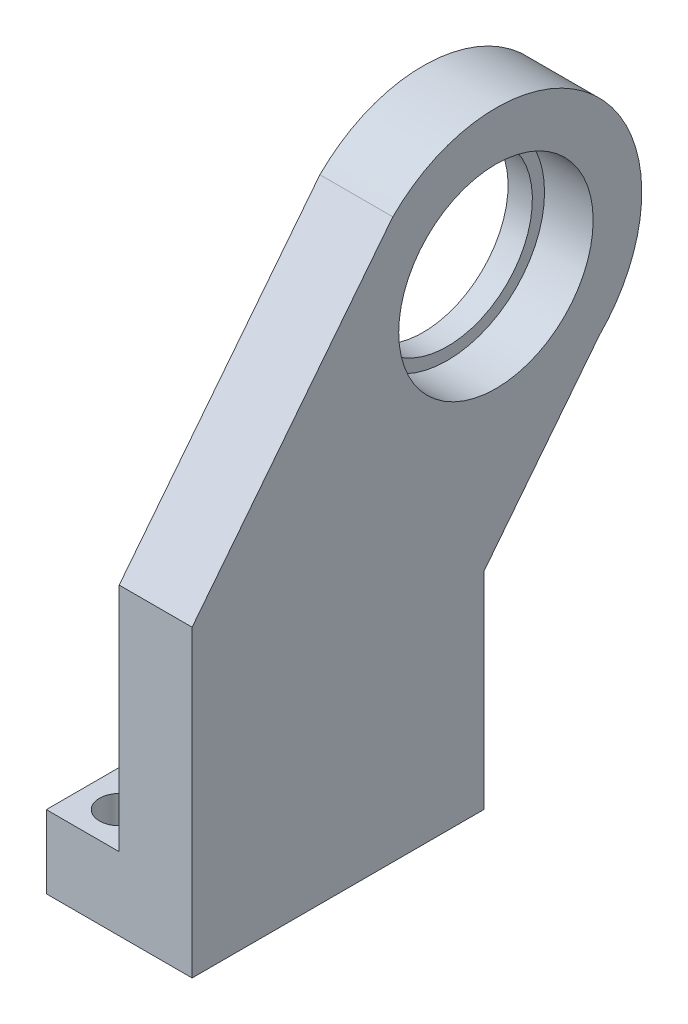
ISO-10303-21;
HEADER;
FILE_DESCRIPTION(('STEP AP214'),'2;1');
FILE_NAME('part.step','',(''),(''),'','','');
FILE_SCHEMA(('AUTOMOTIVE_DESIGN { 1 0 10303 214 1 1 1 1 }'));
ENDSEC;
DATA;
#1=APPLICATION_CONTEXT('core data for automotive mechanical design processes');
#2=APPLICATION_PROTOCOL_DEFINITION('international standard','automotive_design',2000,#1);
#3=PRODUCT_CONTEXT('',#1,'mechanical');
#4=PRODUCT('Part','Part','',(#3));
#5=PRODUCT_RELATED_PRODUCT_CATEGORY('part','',(#4));
#6=PRODUCT_DEFINITION_FORMATION('','',#4);
#7=PRODUCT_DEFINITION_CONTEXT('part definition',#1,'design');
#8=PRODUCT_DEFINITION('design','',#6,#7);
#9=PRODUCT_DEFINITION_SHAPE('','',#8);
#10=(LENGTH_UNIT() NAMED_UNIT(*) SI_UNIT(.MILLI.,.METRE.));
#11=(NAMED_UNIT(*) PLANE_ANGLE_UNIT() SI_UNIT($,.RADIAN.));
#12=(NAMED_UNIT(*) SI_UNIT($,.STERADIAN.) SOLID_ANGLE_UNIT());
#13=UNCERTAINTY_MEASURE_WITH_UNIT(LENGTH_MEASURE(1.E-05),#10,'distance_accuracy_value','');
#14=(GEOMETRIC_REPRESENTATION_CONTEXT(3) GLOBAL_UNCERTAINTY_ASSIGNED_CONTEXT((#13)) GLOBAL_UNIT_ASSIGNED_CONTEXT((#10,
#11,#12)) REPRESENTATION_CONTEXT('',''));
#15=CARTESIAN_POINT('',(0.,0.,0.));
#16=DIRECTION('',(0.,0.,1.));
#17=DIRECTION('',(1.,0.,0.));
#18=AXIS2_PLACEMENT_3D('',#15,#16,#17);
#19=CARTESIAN_POINT('',(-12.,25.,50.));
#20=DIRECTION('',(1.,0.,0.));
#21=DIRECTION('',(0.,1.,0.));
#22=AXIS2_PLACEMENT_3D('',#19,#20,#21);
#23=CYLINDRICAL_SURFACE('',#22,14.);
#24=CARTESIAN_POINT('',(0.,25.,50.));
#25=DIRECTION('',(1.,0.,0.));
#26=DIRECTION('',(0.,1.,0.));
#27=AXIS2_PLACEMENT_3D('',#24,#25,#26);
#28=CIRCLE('',#27,14.);
#29=CARTESIAN_POINT('',(0.,39.,50.));
#30=VERTEX_POINT('',#29);
#31=EDGE_CURVE('E195',#30,#30,#28,.F.);
#32=ORIENTED_EDGE('',*,*,#31,.T.);
#33=EDGE_LOOP('',(#32));
#34=FACE_BOUND('',#33,.T.);
#35=CARTESIAN_POINT('',(3.99999999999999,25.,50.));
#36=DIRECTION('',(1.,0.,0.));
#37=DIRECTION('',(0.,1.,0.));
#38=AXIS2_PLACEMENT_3D('',#35,#36,#37);
#39=CIRCLE('',#38,14.);
#40=CARTESIAN_POINT('',(3.99999999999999,39.,50.));
#41=VERTEX_POINT('',#40);
#42=EDGE_CURVE('E20',#41,#41,#39,.F.);
#43=ORIENTED_EDGE('',*,*,#42,.F.);
#44=EDGE_LOOP('',(#43));
#45=FACE_BOUND('',#44,.T.);
#46=ADVANCED_FACE('F17',(#34,#45),#23,.F.);
#47=CARTESIAN_POINT('',(4.,25.,50.));
#48=DIRECTION('',(1.,0.,0.));
#49=DIRECTION('',(0.,1.,0.));
#50=AXIS2_PLACEMENT_3D('',#47,#48,#49);
#51=PLANE('',#50);
#52=CARTESIAN_POINT('',(4.,25.,50.));
#53=DIRECTION('',(1.,0.,0.));
#54=DIRECTION('',(0.,1.,0.));
#55=AXIS2_PLACEMENT_3D('',#52,#53,#54);
#56=CIRCLE('',#55,16.);
#57=CARTESIAN_POINT('',(3.99999999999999,41.,50.));
#58=VERTEX_POINT('',#57);
#59=EDGE_CURVE('E177',#58,#58,#56,.T.);
#60=ORIENTED_EDGE('',*,*,#59,.T.);
#61=EDGE_LOOP('',(#60));
#62=FACE_BOUND('',#61,.T.);
#63=ORIENTED_EDGE('',*,*,#42,.T.);
#64=EDGE_LOOP('',(#63));
#65=FACE_BOUND('',#64,.T.);
#66=ADVANCED_FACE('F202',(#62,#65),#51,.T.);
#67=CARTESIAN_POINT('',(-6.,-50.,94.));
#68=DIRECTION('',(0.,1.,0.));
#69=DIRECTION('',(-1.,0.,0.));
#70=AXIS2_PLACEMENT_3D('',#67,#68,#69);
#71=CYLINDRICAL_SURFACE('',#70,3.25);
#72=CARTESIAN_POINT('',(-6.,-50.,94.));
#73=DIRECTION('',(0.,1.,0.));
#74=DIRECTION('',(-1.,0.,0.));
#75=AXIS2_PLACEMENT_3D('',#72,#73,#74);
#76=CIRCLE('',#75,3.25);
#77=CARTESIAN_POINT('',(-9.25,-50.,94.));
#78=VERTEX_POINT('',#77);
#79=EDGE_CURVE('E186',#78,#78,#76,.F.);
#80=ORIENTED_EDGE('',*,*,#79,.T.);
#81=EDGE_LOOP('',(#80));
#82=FACE_BOUND('',#81,.T.);
#83=CARTESIAN_POINT('',(-5.99999999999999,-38.,94.));
#84=DIRECTION('',(0.,1.,0.));
#85=DIRECTION('',(-1.,0.,0.));
#86=AXIS2_PLACEMENT_3D('',#83,#84,#85);
#87=CIRCLE('',#86,3.25);
#88=CARTESIAN_POINT('',(-9.24999999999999,-38.,94.));
#89=VERTEX_POINT('',#88);
#90=EDGE_CURVE('E193',#89,#89,#87,.T.);
#91=ORIENTED_EDGE('',*,*,#90,.T.);
#92=EDGE_LOOP('',(#91));
#93=FACE_BOUND('',#92,.T.);
#94=ADVANCED_FACE('F209',(#82,#93),#71,.F.);
#95=CARTESIAN_POINT('',(-6.00000000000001,-50.,58.));
#96=DIRECTION('',(0.,1.,0.));
#97=DIRECTION('',(-1.,0.,0.));
#98=AXIS2_PLACEMENT_3D('',#95,#96,#97);
#99=CYLINDRICAL_SURFACE('',#98,3.25);
#100=CARTESIAN_POINT('',(-6.00000000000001,-50.,58.));
#101=DIRECTION('',(0.,1.,0.));
#102=DIRECTION('',(-1.,0.,0.));
#103=AXIS2_PLACEMENT_3D('',#100,#101,#102);
#104=CIRCLE('',#103,3.25);
#105=CARTESIAN_POINT('',(-9.25000000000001,-50.,58.));
#106=VERTEX_POINT('',#105);
#107=EDGE_CURVE('E138',#106,#106,#104,.F.);
#108=ORIENTED_EDGE('',*,*,#107,.T.);
#109=EDGE_LOOP('',(#108));
#110=FACE_BOUND('',#109,.T.);
#111=CARTESIAN_POINT('',(-5.99999999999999,-38.,58.));
#112=DIRECTION('',(0.,1.,0.));
#113=DIRECTION('',(-1.,0.,0.));
#114=AXIS2_PLACEMENT_3D('',#111,#112,#113);
#115=CIRCLE('',#114,3.25);
#116=CARTESIAN_POINT('',(-9.24999999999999,-38.,58.));
#117=VERTEX_POINT('',#116);
#118=EDGE_CURVE('E159',#117,#117,#115,.T.);
#119=ORIENTED_EDGE('',*,*,#118,.T.);
#120=EDGE_LOOP('',(#119));
#121=FACE_BOUND('',#120,.T.);
#122=ADVANCED_FACE('F252',(#110,#121),#99,.F.);
#123=CARTESIAN_POINT('',(0.,50.,0.));
#124=DIRECTION('',(1.,0.,0.));
#125=DIRECTION('',(0.,1.,0.));
#126=AXIS2_PLACEMENT_3D('',#123,#124,#125);
#127=PLANE('',#126);
#128=DIRECTION('',(0.,0.,1.));
#129=VECTOR('',#128,1.);
#130=CARTESIAN_POINT('',(0.,-38.,0.));
#131=LINE('',#130,#129);
#132=CARTESIAN_POINT('',(0.,-38.,52.));
#133=VERTEX_POINT('',#132);
#134=CARTESIAN_POINT('',(0.,-38.,100.));
#135=VERTEX_POINT('',#134);
#136=EDGE_CURVE('E156',#133,#135,#131,.T.);
#137=ORIENTED_EDGE('',*,*,#136,.T.);
#138=DIRECTION('',(0.,1.,0.));
#139=VECTOR('',#138,1.);
#140=CARTESIAN_POINT('',(0.,0.,100.));
#141=LINE('',#140,#139);
#142=CARTESIAN_POINT('',(0.,0.,100.));
#143=VERTEX_POINT('',#142);
#144=EDGE_CURVE('E96',#143,#135,#141,.F.);
#145=ORIENTED_EDGE('',*,*,#144,.F.);
#146=DIRECTION('',(0.,-0.785839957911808,0.618429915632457));
#147=VECTOR('',#146,1.);
#148=CARTESIAN_POINT('',(0.,0.,100.));
#149=LINE('',#148,#147);
#150=CARTESIAN_POINT('',(0.,41.9705627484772,66.9705627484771));
#151=VERTEX_POINT('',#150);
#152=EDGE_CURVE('E92',#151,#143,#149,.T.);
#153=ORIENTED_EDGE('',*,*,#152,.F.);
#154=CARTESIAN_POINT('',(0.,25.,50.));
#155=DIRECTION('',(1.,0.,0.));
#156=DIRECTION('',(0.,1.,0.));
#157=AXIS2_PLACEMENT_3D('',#154,#155,#156);
#158=CIRCLE('',#157,24.);
#159=CARTESIAN_POINT('',(0.,8.02943725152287,33.0294372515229));
#160=VERTEX_POINT('',#159);
#161=EDGE_CURVE('E82',#160,#151,#158,.T.);
#162=ORIENTED_EDGE('',*,*,#161,.F.);
#163=DIRECTION('',(0.,0.785839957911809,-0.618429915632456));
#164=VECTOR('',#163,1.);
#165=CARTESIAN_POINT('',(0.,8.02943725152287,33.0294372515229));
#166=LINE('',#165,#164);
#167=CARTESIAN_POINT('',(0.,-16.0764894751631,52.));
#168=VERTEX_POINT('',#167);
#169=EDGE_CURVE('E77',#168,#160,#166,.T.);
#170=ORIENTED_EDGE('',*,*,#169,.F.);
#171=DIRECTION('',(0.,1.,0.));
#172=VECTOR('',#171,1.);
#173=CARTESIAN_POINT('',(0.,-16.0764894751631,52.));
#174=LINE('',#173,#172);
#175=EDGE_CURVE('E148',#133,#168,#174,.T.);
#176=ORIENTED_EDGE('',*,*,#175,.F.);
#177=EDGE_LOOP('',(#137,#145,#153,#162,#170,#176));
#178=FACE_BOUND('',#177,.T.);
#179=ORIENTED_EDGE('',*,*,#31,.F.);
#180=EDGE_LOOP('',(#179));
#181=FACE_BOUND('',#180,.T.);
#182=ADVANCED_FACE('F94',(#178,#181),#127,.F.);
#183=CARTESIAN_POINT('',(-12.,50.,100.));
#184=DIRECTION('',(1.,0.,0.));
#185=DIRECTION('',(0.,1.,0.));
#186=AXIS2_PLACEMENT_3D('',#183,#184,#185);
#187=PLANE('',#186);
#188=DIRECTION('',(0.,0.,1.));
#189=VECTOR('',#188,1.);
#190=CARTESIAN_POINT('',(-12.,-50.,100.));
#191=LINE('',#190,#189);
#192=CARTESIAN_POINT('',(-12.,-50.,52.));
#193=VERTEX_POINT('',#192);
#194=CARTESIAN_POINT('',(-12.,-50.,100.));
#195=VERTEX_POINT('',#194);
#196=EDGE_CURVE('E135',#193,#195,#191,.T.);
#197=ORIENTED_EDGE('',*,*,#196,.T.);
#198=DIRECTION('',(0.,1.,0.));
#199=VECTOR('',#198,1.);
#200=CARTESIAN_POINT('',(-12.,0.,100.));
#201=LINE('',#200,#199);
#202=CARTESIAN_POINT('',(-12.,-38.,100.));
#203=VERTEX_POINT('',#202);
#204=EDGE_CURVE('E121',#203,#195,#201,.F.);
#205=ORIENTED_EDGE('',*,*,#204,.F.);
#206=DIRECTION('',(0.,0.,1.));
#207=VECTOR('',#206,1.);
#208=CARTESIAN_POINT('',(-12.,-38.,0.));
#209=LINE('',#208,#207);
#210=CARTESIAN_POINT('',(-12.,-38.,52.));
#211=VERTEX_POINT('',#210);
#212=EDGE_CURVE('E158',#203,#211,#209,.F.);
#213=ORIENTED_EDGE('',*,*,#212,.T.);
#214=DIRECTION('',(0.,1.,0.));
#215=VECTOR('',#214,1.);
#216=CARTESIAN_POINT('',(-12.,-16.0764894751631,52.));
#217=LINE('',#216,#215);
#218=EDGE_CURVE('E132',#193,#211,#217,.T.);
#219=ORIENTED_EDGE('',*,*,#218,.F.);
#220=EDGE_LOOP('',(#197,#205,#213,#219));
#221=FACE_BOUND('',#220,.T.);
#222=ADVANCED_FACE('F245',(#221),#187,.F.);
#223=CARTESIAN_POINT('',(-12.,-38.,0.));
#224=DIRECTION('',(0.,-1.,0.));
#225=DIRECTION('',(1.,0.,0.));
#226=AXIS2_PLACEMENT_3D('',#223,#224,#225);
#227=PLANE('',#226);
#228=ORIENTED_EDGE('',*,*,#212,.F.);
#229=DIRECTION('',(1.,0.,0.));
#230=VECTOR('',#229,1.);
#231=CARTESIAN_POINT('',(0.,-38.,100.));
#232=LINE('',#231,#230);
#233=EDGE_CURVE('E165',#135,#203,#232,.F.);
#234=ORIENTED_EDGE('',*,*,#233,.F.);
#235=ORIENTED_EDGE('',*,*,#136,.F.);
#236=DIRECTION('',(1.,0.,0.));
#237=VECTOR('',#236,1.);
#238=CARTESIAN_POINT('',(-12.,-38.,52.));
#239=LINE('',#238,#237);
#240=EDGE_CURVE('E142',#211,#133,#239,.T.);
#241=ORIENTED_EDGE('',*,*,#240,.F.);
#242=EDGE_LOOP('',(#228,#234,#235,#241));
#243=FACE_BOUND('',#242,.T.);
#244=ORIENTED_EDGE('',*,*,#118,.F.);
#245=EDGE_LOOP('',(#244));
#246=FACE_BOUND('',#245,.T.);
#247=ORIENTED_EDGE('',*,*,#90,.F.);
#248=EDGE_LOOP('',(#247));
#249=FACE_BOUND('',#248,.T.);
#250=ADVANCED_FACE('F241',(#243,#246,#249),#227,.F.);
#251=CARTESIAN_POINT('',(4.,25.,50.));
#252=DIRECTION('',(1.,0.,0.));
#253=DIRECTION('',(0.,1.,0.));
#254=AXIS2_PLACEMENT_3D('',#251,#252,#253);
#255=CYLINDRICAL_SURFACE('',#254,16.);
#256=ORIENTED_EDGE('',*,*,#59,.F.);
#257=EDGE_LOOP('',(#256));
#258=FACE_BOUND('',#257,.T.);
#259=CARTESIAN_POINT('',(12.,25.,50.));
#260=DIRECTION('',(1.,0.,0.));
#261=DIRECTION('',(0.,1.,0.));
#262=AXIS2_PLACEMENT_3D('',#259,#260,#261);
#263=CIRCLE('',#262,16.);
#264=CARTESIAN_POINT('',(12.,41.,50.));
#265=VERTEX_POINT('',#264);
#266=EDGE_CURVE('E126',#265,#265,#263,.T.);
#267=ORIENTED_EDGE('',*,*,#266,.T.);
#268=EDGE_LOOP('',(#267));
#269=FACE_BOUND('',#268,.T.);
#270=ADVANCED_FACE('F237',(#258,#269),#255,.F.);
#271=CARTESIAN_POINT('',(-12.,-50.,100.));
#272=DIRECTION('',(0.,1.,0.));
#273=DIRECTION('',(0.,0.,1.));
#274=AXIS2_PLACEMENT_3D('',#271,#272,#273);
#275=PLANE('',#274);
#276=DIRECTION('',(0.,0.,1.));
#277=VECTOR('',#276,1.);
#278=CARTESIAN_POINT('',(12.,-50.,100.));
#279=LINE('',#278,#277);
#280=CARTESIAN_POINT('',(12.,-50.,52.));
#281=VERTEX_POINT('',#280);
#282=CARTESIAN_POINT('',(12.,-50.,100.));
#283=VERTEX_POINT('',#282);
#284=EDGE_CURVE('E117',#281,#283,#279,.T.);
#285=ORIENTED_EDGE('',*,*,#284,.T.);
#286=DIRECTION('',(1.,0.,0.));
#287=VECTOR('',#286,1.);
#288=CARTESIAN_POINT('',(0.,-50.,100.));
#289=LINE('',#288,#287);
#290=EDGE_CURVE('E100',#195,#283,#289,.T.);
#291=ORIENTED_EDGE('',*,*,#290,.F.);
#292=ORIENTED_EDGE('',*,*,#196,.F.);
#293=DIRECTION('',(1.,0.,0.));
#294=VECTOR('',#293,1.);
#295=CARTESIAN_POINT('',(-12.,-50.,52.));
#296=LINE('',#295,#294);
#297=EDGE_CURVE('E129',#281,#193,#296,.F.);
#298=ORIENTED_EDGE('',*,*,#297,.F.);
#299=EDGE_LOOP('',(#285,#291,#292,#298));
#300=FACE_BOUND('',#299,.T.);
#301=ORIENTED_EDGE('',*,*,#107,.F.);
#302=EDGE_LOOP('',(#301));
#303=FACE_BOUND('',#302,.T.);
#304=ORIENTED_EDGE('',*,*,#79,.F.);
#305=EDGE_LOOP('',(#304));
#306=FACE_BOUND('',#305,.T.);
#307=ADVANCED_FACE('F233',(#300,#303,#306),#275,.F.);
#308=CARTESIAN_POINT('',(0.,0.,100.));
#309=DIRECTION('',(0.,0.,1.));
#310=DIRECTION('',(1.,0.,0.));
#311=AXIS2_PLACEMENT_3D('',#308,#309,#310);
#312=PLANE('',#311);
#313=ORIENTED_EDGE('',*,*,#204,.T.);
#314=ORIENTED_EDGE('',*,*,#290,.T.);
#315=DIRECTION('',(0.,-1.,0.));
#316=VECTOR('',#315,1.);
#317=CARTESIAN_POINT('',(12.,50.,100.));
#318=LINE('',#317,#316);
#319=CARTESIAN_POINT('',(12.,0.,100.));
#320=VERTEX_POINT('',#319);
#321=EDGE_CURVE('E114',#283,#320,#318,.F.);
#322=ORIENTED_EDGE('',*,*,#321,.T.);
#323=DIRECTION('',(1.,0.,0.));
#324=VECTOR('',#323,1.);
#325=CARTESIAN_POINT('',(-12.,0.,100.));
#326=LINE('',#325,#324);
#327=EDGE_CURVE('E99',#143,#320,#326,.T.);
#328=ORIENTED_EDGE('',*,*,#327,.F.);
#329=ORIENTED_EDGE('',*,*,#144,.T.);
#330=ORIENTED_EDGE('',*,*,#233,.T.);
#331=EDGE_LOOP('',(#313,#314,#322,#328,#329,#330));
#332=FACE_BOUND('',#331,.T.);
#333=ADVANCED_FACE('F230',(#332),#312,.T.);
#334=CARTESIAN_POINT('',(-12.,0.,100.));
#335=DIRECTION('',(0.,0.618429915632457,0.785839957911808));
#336=DIRECTION('',(0.,-0.785839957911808,0.618429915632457));
#337=AXIS2_PLACEMENT_3D('',#334,#335,#336);
#338=PLANE('',#337);
#339=DIRECTION('',(0.,0.785839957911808,-0.618429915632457));
#340=VECTOR('',#339,1.);
#341=CARTESIAN_POINT('',(12.,0.,100.));
#342=LINE('',#341,#340);
#343=CARTESIAN_POINT('',(12.,41.9705627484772,66.9705627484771));
#344=VERTEX_POINT('',#343);
#345=EDGE_CURVE('E105',#320,#344,#342,.T.);
#346=ORIENTED_EDGE('',*,*,#345,.T.);
#347=DIRECTION('',(1.,0.,0.));
#348=VECTOR('',#347,1.);
#349=CARTESIAN_POINT('',(-12.,41.9705627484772,66.9705627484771));
#350=LINE('',#349,#348);
#351=EDGE_CURVE('E86',#151,#344,#350,.T.);
#352=ORIENTED_EDGE('',*,*,#351,.F.);
#353=ORIENTED_EDGE('',*,*,#152,.T.);
#354=ORIENTED_EDGE('',*,*,#327,.T.);
#355=EDGE_LOOP('',(#346,#352,#353,#354));
#356=FACE_BOUND('',#355,.T.);
#357=ADVANCED_FACE('F103',(#356),#338,.T.);
#358=CARTESIAN_POINT('',(-12.,25.,50.));
#359=DIRECTION('',(1.,0.,0.));
#360=DIRECTION('',(0.,1.,0.));
#361=AXIS2_PLACEMENT_3D('',#358,#359,#360);
#362=CYLINDRICAL_SURFACE('',#361,24.);
#363=CARTESIAN_POINT('',(12.,25.,50.));
#364=DIRECTION('',(1.,0.,0.));
#365=DIRECTION('',(0.,1.,0.));
#366=AXIS2_PLACEMENT_3D('',#363,#364,#365);
#367=CIRCLE('',#366,24.);
#368=CARTESIAN_POINT('',(12.,8.02943725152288,33.0294372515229));
#369=VERTEX_POINT('',#368);
#370=EDGE_CURVE('E180',#344,#369,#367,.F.);
#371=ORIENTED_EDGE('',*,*,#370,.T.);
#372=DIRECTION('',(1.,0.,0.));
#373=VECTOR('',#372,1.);
#374=CARTESIAN_POINT('',(-12.,8.02943725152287,33.0294372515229));
#375=LINE('',#374,#373);
#376=EDGE_CURVE('E88',#160,#369,#375,.T.);
#377=ORIENTED_EDGE('',*,*,#376,.F.);
#378=ORIENTED_EDGE('',*,*,#161,.T.);
#379=ORIENTED_EDGE('',*,*,#351,.T.);
#380=EDGE_LOOP('',(#371,#377,#378,#379));
#381=FACE_BOUND('',#380,.T.);
#382=ADVANCED_FACE('F84',(#381),#362,.T.);
#383=CARTESIAN_POINT('',(-12.,8.02943725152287,33.0294372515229));
#384=DIRECTION('',(0.,-0.618429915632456,-0.785839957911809));
#385=DIRECTION('',(0.,0.785839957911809,-0.618429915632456));
#386=AXIS2_PLACEMENT_3D('',#383,#384,#385);
#387=PLANE('',#386);
#388=DIRECTION('',(0.,-0.785839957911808,0.618429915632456));
#389=VECTOR('',#388,1.);
#390=CARTESIAN_POINT('',(12.,8.02943725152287,33.0294372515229));
#391=LINE('',#390,#389);
#392=CARTESIAN_POINT('',(12.,-16.0764894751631,52.));
#393=VERTEX_POINT('',#392);
#394=EDGE_CURVE('E26',#369,#393,#391,.T.);
#395=ORIENTED_EDGE('',*,*,#394,.T.);
#396=DIRECTION('',(1.,0.,0.));
#397=VECTOR('',#396,1.);
#398=CARTESIAN_POINT('',(-12.,-16.0764894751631,52.));
#399=LINE('',#398,#397);
#400=EDGE_CURVE('E34',#168,#393,#399,.T.);
#401=ORIENTED_EDGE('',*,*,#400,.F.);
#402=ORIENTED_EDGE('',*,*,#169,.T.);
#403=ORIENTED_EDGE('',*,*,#376,.T.);
#404=EDGE_LOOP('',(#395,#401,#402,#403));
#405=FACE_BOUND('',#404,.T.);
#406=ADVANCED_FACE('F219',(#405),#387,.T.);
#407=CARTESIAN_POINT('',(-12.,-16.0764894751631,52.));
#408=DIRECTION('',(0.,0.,-1.));
#409=DIRECTION('',(0.,1.,0.));
#410=AXIS2_PLACEMENT_3D('',#407,#408,#409);
#411=PLANE('',#410);
#412=ORIENTED_EDGE('',*,*,#218,.T.);
#413=ORIENTED_EDGE('',*,*,#240,.T.);
#414=ORIENTED_EDGE('',*,*,#175,.T.);
#415=ORIENTED_EDGE('',*,*,#400,.T.);
#416=DIRECTION('',(0.,-1.,0.));
#417=VECTOR('',#416,1.);
#418=CARTESIAN_POINT('',(12.,50.,52.));
#419=LINE('',#418,#417);
#420=EDGE_CURVE('E11',#393,#281,#419,.T.);
#421=ORIENTED_EDGE('',*,*,#420,.T.);
#422=ORIENTED_EDGE('',*,*,#297,.T.);
#423=EDGE_LOOP('',(#412,#413,#414,#415,#421,#422));
#424=FACE_BOUND('',#423,.T.);
#425=ADVANCED_FACE('F213',(#424),#411,.T.);
#426=CARTESIAN_POINT('',(12.,50.,100.));
#427=DIRECTION('',(-1.,0.,0.));
#428=DIRECTION('',(0.,-1.,0.));
#429=AXIS2_PLACEMENT_3D('',#426,#427,#428);
#430=PLANE('',#429);
#431=ORIENTED_EDGE('',*,*,#394,.F.);
#432=ORIENTED_EDGE('',*,*,#370,.F.);
#433=ORIENTED_EDGE('',*,*,#345,.F.);
#434=ORIENTED_EDGE('',*,*,#321,.F.);
#435=ORIENTED_EDGE('',*,*,#284,.F.);
#436=ORIENTED_EDGE('',*,*,#420,.F.);
#437=EDGE_LOOP('',(#431,#432,#433,#434,#435,#436));
#438=FACE_BOUND('',#437,.T.);
#439=ORIENTED_EDGE('',*,*,#266,.F.);
#440=EDGE_LOOP('',(#439));
#441=FACE_BOUND('',#440,.T.);
#442=ADVANCED_FACE('F211',(#438,#441),#430,.F.);
#443=CLOSED_SHELL('',(#46,#66,#94,#122,#182,#222,#250,#270,#307,#333,#357,#382,#406,#425,#442));
#444=MANIFOLD_SOLID_BREP('B1',#443);
#445=ADVANCED_BREP_SHAPE_REPRESENTATION('',(#18,#444),#14);
#446=SHAPE_DEFINITION_REPRESENTATION(#9,#445);
ENDSEC;
END-ISO-10303-21;
